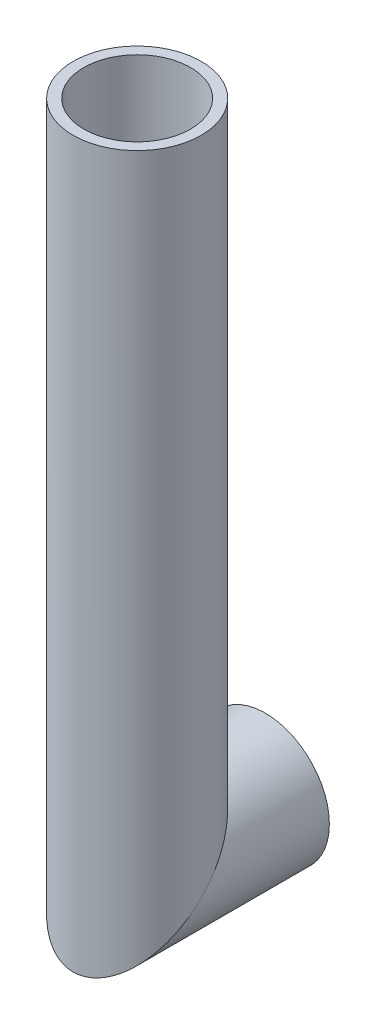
from build123d import *

# Parameters (mm, degrees)
CROQUIS2_R   = 6
CROQUIS2_R_2 = 5


with BuildPart() as part:
    # Barrer6: sweep along a path in Croquis13
    with BuildLine(Plane(origin=(0, 0, 0), x_dir=(0, 0, -1), z_dir=(1, 0, 0))) as barrer6_path:
        Line((0, 0), (-12, 0))
        Line((-12, 0), (-12, 61.86))
    # Croquis2 → Barrer6 (sweep)
    with BuildSketch(Plane.XY):
        Circle(CROQUIS2_R)
        Circle(CROQUIS2_R_2, mode=Mode.SUBTRACT)
    sweep(path=barrer6_path.line, transition=Transition.RIGHT)


solid = part.part
